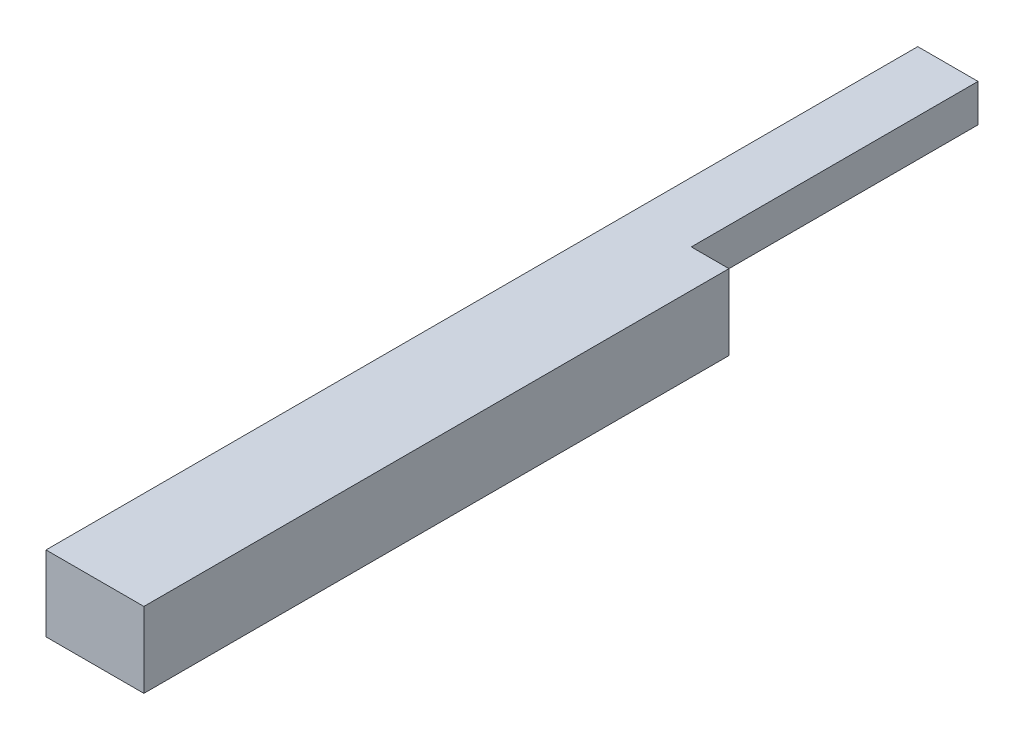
from build123d import *

# Parameters (mm, degrees)
SKETCH_1_W          = 130
SKETCH_1_H          = 100
EXTRUDE_1_DEPTH     = 1157.62
CUT_EXTRUDE_START   = -50
SKETCH_2_W          = 380.692245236
SKETCH_2_H          = 100
CUT_EXTRUDE_1_DEPTH = 50
SKETCH_3_W          = 80
SKETCH_3_H          = 359.313641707
CUT_EXTRUDE_2_DEPTH = 50


with BuildPart() as part:
    # Sketch 1 → Extrude 1 (new body)
    with BuildSketch(Plane.XY):
        with Locations((17.71816701, 69.808847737)):
            Rectangle(SKETCH_1_W, SKETCH_1_H)
    extrude(amount=-EXTRUDE_1_DEPTH)

    # Sketch 2 → Cut-Extrude 1 (cut)
    with BuildSketch(Plane(origin=(82.71816701, 0, 0), x_dir=(0, 0, -1), z_dir=(1, 0, 0)).offset(CUT_EXTRUDE_START)):
        with Locations((967.273877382, 69.808847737)):
            Rectangle(SKETCH_2_W, SKETCH_2_H)
    extrude(amount=CUT_EXTRUDE_1_DEPTH, mode=Mode.SUBTRACT)

    # Sketch 3 → Cut-Extrude 2 (cut)
    with BuildSketch(Plane.XZ.offset(-19.808847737).offset(CUT_EXTRUDE_START)):
        with Locations((-7.28183299, -977.963179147)):
            Rectangle(SKETCH_3_W, SKETCH_3_H)
    extrude(amount=CUT_EXTRUDE_2_DEPTH, mode=Mode.SUBTRACT)


solid = part.part
